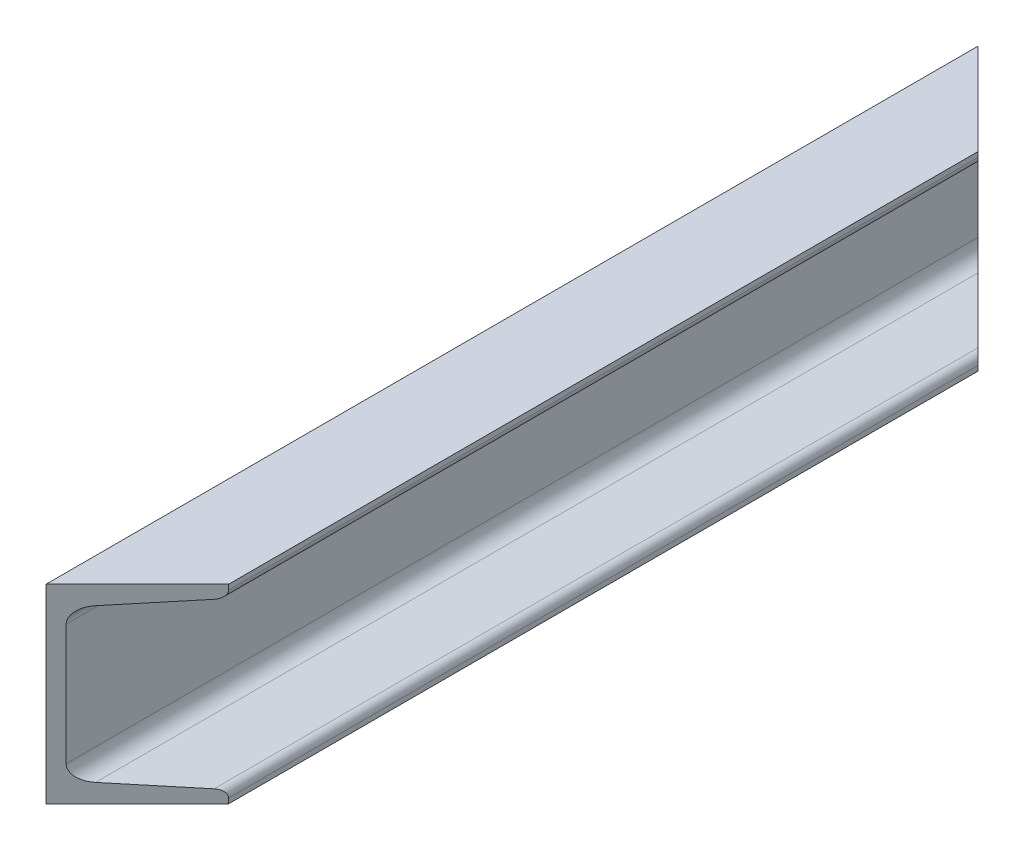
from build123d import *

# Parameters (mm, degrees)
EXTRUDE_1_DEPTH     = 490
CUT_EXTRUDE_1_DEPTH = 490


with BuildPart() as part:
    # Sketch 1 → Extrude 1 (new body)
    with BuildSketch(Plane.XY):
        with BuildLine():
            Line((48, 50), (0, 50))
            Line((0, 50), (0, -50))
            Line((0, -50), (48, -50))
            Line((48, -50), (48, -47.324945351))
            ThreePointArc((48, -47.324945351), (46.905258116, -44.496982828), (44.191727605, -43.143253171))
            Line((44.191727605, -43.143253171), (13.007217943, -40.221987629))
            ThreePointArc((13.007217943, -40.221987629), (7.51554905, -37.482296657), (5.3, -31.759039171))
            Line((5.3, -31.759039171), (5.3, 31.759039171))
            ThreePointArc((5.3, 31.759039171), (7.51554905, 37.482296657), (13.007217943, 40.221987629))
            Line((13.007217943, 40.221987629), (44.191727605, 43.143253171))
            ThreePointArc((44.191727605, 43.143253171), (46.905258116, 44.496982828), (48, 47.324945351))
            Line((48, 47.324945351), (48, 50))
        make_face()
    extrude(amount=EXTRUDE_1_DEPTH)

    # Sketch 2 → Cut-Extrude 1 (cut)
    with BuildSketch(Plane(origin=(0, 50, 0), x_dir=(-1, 0, 0), z_dir=(0, 1, 0))):
        Polygon((-48, 490), (-48, 442), (0, 490), align=None)
        Polygon((-48, 0), (-48, 48), (0, 0), align=None)
    extrude(amount=-CUT_EXTRUDE_1_DEPTH, mode=Mode.SUBTRACT)


solid = part.part
